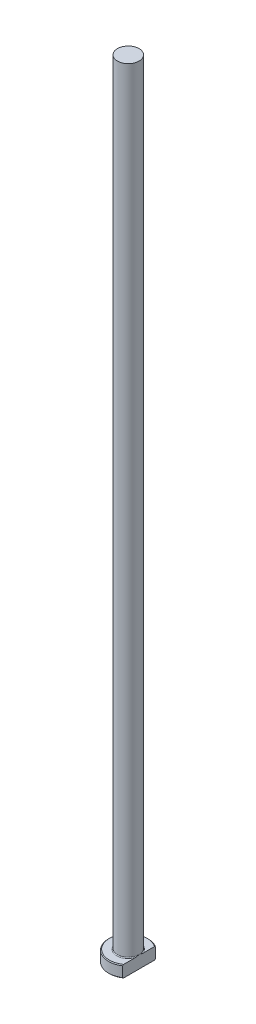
from build123d import *
from build123d.topology import SkipClean

# Parameters (mm, degrees)
CHAMFER1_SIZE = 0.2
FILLET1_R     = 0.2
KEY_DEPTH     = 201.124960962


with BuildPart() as part:
    # Sketch1 → Revolve1 (revolve)
    with BuildSketch(Plane.XY, mode=Mode.PRIVATE) as revolve1_sk:
        Polygon((0, 0), (-5, 0), (-5, 3), (-2.75, 3), (-2.75, 200), (0, 200), align=None)
    revolve(revolve1_sk.sketch.rotate(Axis((0, 259.958771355, 0), (0, -1, 0)), 270), axis=Axis((0, 259.958771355, 0), (0, -1, 0)))

    # Chamfer1
    chamfer1_edges = [part.edges().sort_by_distance(p)[0] for p in [
        (0, 3, -5),
        (0, 0, -5),
    ]]
    chamfer(chamfer1_edges, length=CHAMFER1_SIZE)

    # Fillet1
    fillet1_edges = [part.edges().sort_by_distance(p)[0] for p in [
        (0, 3, -2.75),
    ]]
    fillet(fillet1_edges, radius=FILLET1_R)

    # Sketch2 → KEY (cut, through all)
    with SkipClean():  # the faces are left unmerged after this step: merging them gives an invalid solid
        with BuildSketch(Plane(origin=(0, 0, 0), x_dir=(1, 0, 0), z_dir=(0, 1, 0))):
            with BuildLine():
                Line((2.75, 4.175823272), (2.75, -4.175823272))
                ThreePointArc((2.75, -4.175823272), (5, 0), (2.75, 4.175823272))
            make_face()
        extrude(amount=KEY_DEPTH, mode=Mode.SUBTRACT)


solid = part.part
